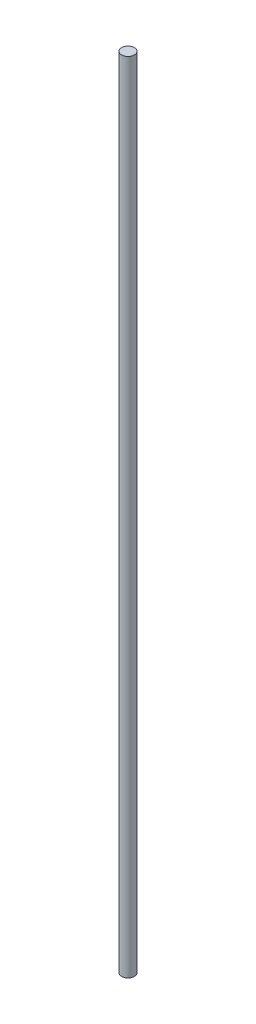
from build123d import *

# Parameters (mm, degrees)
SKETCH_1_R      = 8
EXTRUDE_1_DEPTH = 1000


with BuildPart() as part:
    # Sketch 1 → Extrude 1 (new body)
    with BuildSketch(Plane(origin=(0, 0, 0), x_dir=(1, 0, 0), z_dir=(0, 1, 0))):
        with Locations(Location((0, 0, 0), (0, 0, 270))):
            Circle(SKETCH_1_R)
    extrude(amount=EXTRUDE_1_DEPTH)


solid = part.part
